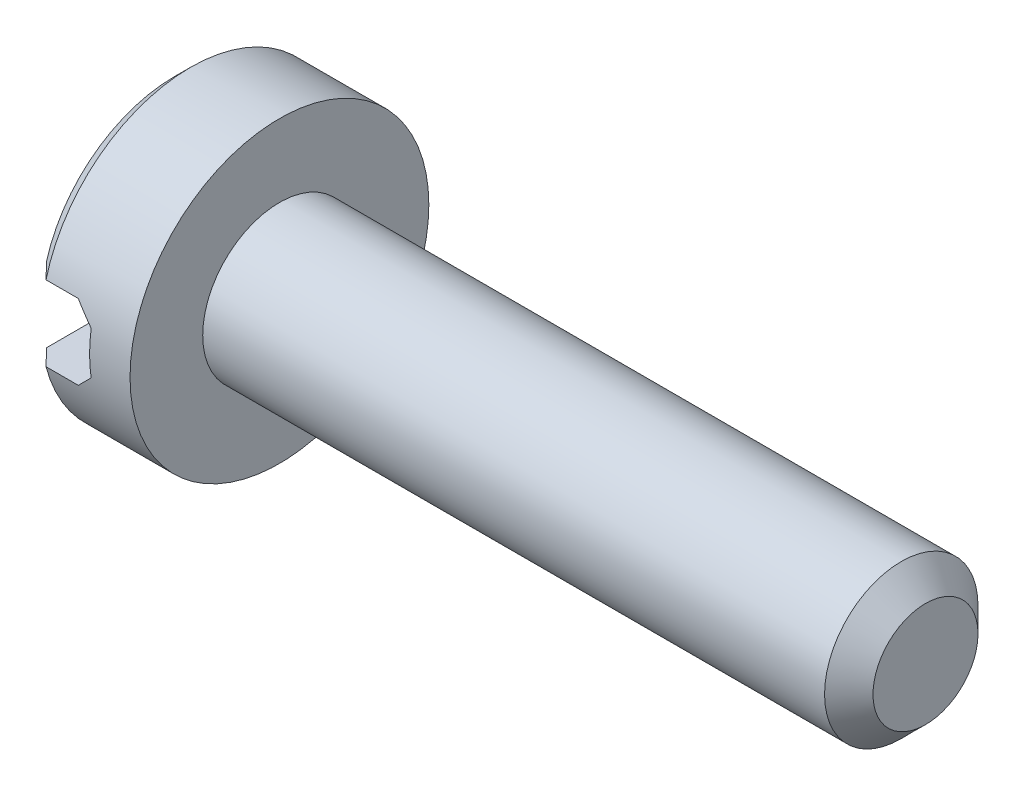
ISO-10303-21;
HEADER;
FILE_DESCRIPTION(('STEP AP214'),'2;1');
FILE_NAME('part.step','',(''),(''),'','','');
FILE_SCHEMA(('AUTOMOTIVE_DESIGN { 1 0 10303 214 1 1 1 1 }'));
ENDSEC;
DATA;
#1=APPLICATION_CONTEXT('core data for automotive mechanical design processes');
#2=APPLICATION_PROTOCOL_DEFINITION('international standard','automotive_design',2000,#1);
#3=PRODUCT_CONTEXT('',#1,'mechanical');
#4=PRODUCT('Part','Part','',(#3));
#5=PRODUCT_RELATED_PRODUCT_CATEGORY('part','',(#4));
#6=PRODUCT_DEFINITION_FORMATION('','',#4);
#7=PRODUCT_DEFINITION_CONTEXT('part definition',#1,'design');
#8=PRODUCT_DEFINITION('design','',#6,#7);
#9=PRODUCT_DEFINITION_SHAPE('','',#8);
#10=(LENGTH_UNIT() NAMED_UNIT(*) SI_UNIT(.MILLI.,.METRE.));
#11=(NAMED_UNIT(*) PLANE_ANGLE_UNIT() SI_UNIT($,.RADIAN.));
#12=(NAMED_UNIT(*) SI_UNIT($,.STERADIAN.) SOLID_ANGLE_UNIT());
#13=UNCERTAINTY_MEASURE_WITH_UNIT(LENGTH_MEASURE(1.E-05),#10,'distance_accuracy_value','');
#14=(GEOMETRIC_REPRESENTATION_CONTEXT(3) GLOBAL_UNCERTAINTY_ASSIGNED_CONTEXT((#13)) GLOBAL_UNIT_ASSIGNED_CONTEXT((#10,
#11,#12)) REPRESENTATION_CONTEXT('',''));
#15=CARTESIAN_POINT('',(0.,0.,0.));
#16=DIRECTION('',(0.,0.,1.));
#17=DIRECTION('',(1.,0.,0.));
#18=AXIS2_PLACEMENT_3D('',#15,#16,#17);
#19=CARTESIAN_POINT('',(1.3,1.85,0.));
#20=DIRECTION('',(-1.,0.,0.));
#21=DIRECTION('',(0.,0.,1.));
#22=AXIS2_PLACEMENT_3D('',#19,#20,#21);
#23=PLANE('',#22);
#24=CARTESIAN_POINT('',(1.3,0.,0.));
#25=DIRECTION('',(-1.,0.,0.));
#26=DIRECTION('',(0.,0.,1.));
#27=AXIS2_PLACEMENT_3D('',#24,#25,#26);
#28=CIRCLE('',#27,1.85);
#29=CARTESIAN_POINT('',(1.3,0.,1.85));
#30=VERTEX_POINT('',#29);
#31=EDGE_CURVE('E111',#30,#30,#28,.T.);
#32=ORIENTED_EDGE('',*,*,#31,.F.);
#33=EDGE_LOOP('',(#32));
#34=FACE_BOUND('',#33,.T.);
#35=CARTESIAN_POINT('',(1.3,0.,0.));
#36=DIRECTION('',(-1.,0.,0.));
#37=DIRECTION('',(0.,0.,1.));
#38=AXIS2_PLACEMENT_3D('',#35,#36,#37);
#39=CIRCLE('',#38,0.95);
#40=CARTESIAN_POINT('',(1.3,0.,0.95));
#41=VERTEX_POINT('',#40);
#42=EDGE_CURVE('E150',#41,#41,#39,.F.);
#43=ORIENTED_EDGE('',*,*,#42,.F.);
#44=EDGE_LOOP('',(#43));
#45=FACE_BOUND('',#44,.T.);
#46=ADVANCED_FACE('F37',(#34,#45),#23,.F.);
#47=CARTESIAN_POINT('',(0.2,0.,0.));
#48=DIRECTION('',(1.,0.,0.));
#49=DIRECTION('',(0.,0.,-1.));
#50=AXIS2_PLACEMENT_3D('',#47,#48,#49);
#51=CONICAL_SURFACE('',#50,1.85,0.785398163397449);
#52=CARTESIAN_POINT('',(0.2,0.,0.));
#53=DIRECTION('',(-1.,0.,0.));
#54=DIRECTION('',(0.,0.,1.));
#55=AXIS2_PLACEMENT_3D('',#52,#53,#54);
#56=CIRCLE('',#55,1.85);
#57=CARTESIAN_POINT('',(0.2,0.465549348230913,1.79046468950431));
#58=VERTEX_POINT('',#57);
#59=CARTESIAN_POINT('',(0.2,0.465549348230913,-1.79046468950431));
#60=VERTEX_POINT('',#59);
#61=EDGE_CURVE('E132',#58,#60,#56,.T.);
#62=ORIENTED_EDGE('',*,*,#61,.T.);
#63=CARTESIAN_POINT('',(2.42344087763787,0.465549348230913,-4.04674985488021));
#64=CARTESIAN_POINT('',(2.31422073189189,0.465549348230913,-3.9368070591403));
#65=CARTESIAN_POINT('',(2.20502763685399,0.465549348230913,-3.82683737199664));
#66=CARTESIAN_POINT('',(1.98669704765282,0.465549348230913,-3.60680197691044));
#67=CARTESIAN_POINT('',(1.87755956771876,0.465549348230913,-3.49673625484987));
#68=CARTESIAN_POINT('',(1.65894933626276,0.465549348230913,-3.27607034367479));
#69=CARTESIAN_POINT('',(1.54947697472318,0.465549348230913,-3.16546976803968));
#70=CARTESIAN_POINT('',(1.33068893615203,0.465549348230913,-2.94415427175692));
#71=CARTESIAN_POINT('',(1.22137323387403,0.465549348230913,-2.83343937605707));
#72=CARTESIAN_POINT('',(0.94158553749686,0.465549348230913,-2.54959909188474));
#73=CARTESIAN_POINT('',(0.771245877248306,0.465549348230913,-2.37634297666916));
#74=CARTESIAN_POINT('',(0.516315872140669,0.465549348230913,-2.11577452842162));
#75=CARTESIAN_POINT('',(0.431406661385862,0.465549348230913,-2.02877427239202));
#76=CARTESIAN_POINT('',(0.261908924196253,0.465549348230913,-1.85447495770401));
#77=CARTESIAN_POINT('',(0.177320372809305,0.465549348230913,-1.76717592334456));
#78=CARTESIAN_POINT('',(0.00893926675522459,0.465549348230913,-1.59244630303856));
#79=CARTESIAN_POINT('',(-0.0748550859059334,0.465549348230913,-1.50501745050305));
#80=CARTESIAN_POINT('',(-0.241707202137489,0.465549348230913,-1.32940591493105));
#81=CARTESIAN_POINT('',(-0.324764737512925,0.465549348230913,-1.24122301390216));
#82=CARTESIAN_POINT('',(-0.448249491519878,0.465549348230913,-1.10803308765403));
#83=CARTESIAN_POINT('',(-0.4892012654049,0.465549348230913,-1.06351303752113));
#84=CARTESIAN_POINT('',(-0.570603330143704,0.465549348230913,-0.974017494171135));
#85=CARTESIAN_POINT('',(-0.61105363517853,0.465549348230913,-0.929042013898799));
#86=CARTESIAN_POINT('',(-0.691196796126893,0.465549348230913,-0.838458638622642));
#87=CARTESIAN_POINT('',(-0.730890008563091,0.465549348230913,-0.792851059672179));
#88=CARTESIAN_POINT('',(-0.809128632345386,0.465549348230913,-0.700664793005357));
#89=CARTESIAN_POINT('',(-0.847674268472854,0.465549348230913,-0.654086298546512));
#90=CARTESIAN_POINT('',(-0.899367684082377,0.465549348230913,-0.588920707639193));
#91=CARTESIAN_POINT('',(-0.913355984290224,0.465549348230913,-0.571002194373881));
#92=CARTESIAN_POINT('',(-0.940978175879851,0.465549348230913,-0.53489334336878));
#93=CARTESIAN_POINT('',(-0.954612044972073,0.465549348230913,-0.516702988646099));
#94=CARTESIAN_POINT('',(-0.994922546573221,0.465549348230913,-0.461548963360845));
#95=CARTESIAN_POINT('',(-1.02093788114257,0.465549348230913,-0.424089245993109));
#96=CARTESIAN_POINT('',(-1.06919063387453,0.465549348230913,-0.348468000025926));
#97=CARTESIAN_POINT('',(-1.09152270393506,0.465549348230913,-0.310367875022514));
#98=CARTESIAN_POINT('',(-1.13109948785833,0.465549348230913,-0.231663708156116));
#99=CARTESIAN_POINT('',(-1.1483700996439,0.465549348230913,-0.191073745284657));
#100=CARTESIAN_POINT('',(-1.16937161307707,0.465549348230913,-0.122137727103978));
#101=CARTESIAN_POINT('',(-1.17573754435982,0.465549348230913,-0.0946292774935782));
#102=CARTESIAN_POINT('',(-1.18362415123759,0.465549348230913,-0.0389959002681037));
#103=CARTESIAN_POINT('',(-1.1851644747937,0.465549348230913,-0.0108739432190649));
#104=CARTESIAN_POINT('',(-1.18310496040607,0.465549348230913,0.0451823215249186));
#105=CARTESIAN_POINT('',(-1.17950248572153,0.465549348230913,0.0731165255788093));
#106=CARTESIAN_POINT('',(-1.16789735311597,0.465549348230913,0.128135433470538));
#107=CARTESIAN_POINT('',(-1.15987428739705,0.465549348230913,0.155215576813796));
#108=CARTESIAN_POINT('',(-1.13863829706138,0.465549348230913,0.213647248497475));
#109=CARTESIAN_POINT('',(-1.12469509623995,0.465549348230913,0.244723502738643));
#110=CARTESIAN_POINT('',(-1.09383840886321,0.465549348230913,0.305390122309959));
#111=CARTESIAN_POINT('',(-1.07691840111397,0.465549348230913,0.334977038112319));
#112=CARTESIAN_POINT('',(-1.04106417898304,0.465549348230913,0.393185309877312));
#113=CARTESIAN_POINT('',(-1.02211606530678,0.465549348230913,0.421797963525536));
#114=CARTESIAN_POINT('',(-0.982981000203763,0.465549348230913,0.478106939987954));
#115=CARTESIAN_POINT('',(-0.962795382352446,0.465549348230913,0.505804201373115));
#116=CARTESIAN_POINT('',(-0.919274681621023,0.465549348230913,0.563580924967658));
#117=CARTESIAN_POINT('',(-0.895838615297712,0.465549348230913,0.593583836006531));
#118=CARTESIAN_POINT('',(-0.848230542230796,0.465549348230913,0.65300190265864));
#119=CARTESIAN_POINT('',(-0.82405844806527,0.465549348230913,0.682416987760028));
#120=CARTESIAN_POINT('',(-0.750747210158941,0.465549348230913,0.770035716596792));
#121=CARTESIAN_POINT('',(-0.700832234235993,0.465549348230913,0.827588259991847));
#122=CARTESIAN_POINT('',(-0.599780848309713,0.465549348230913,0.941762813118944));
#123=CARTESIAN_POINT('',(-0.548642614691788,0.465549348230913,0.998383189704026));
#124=CARTESIAN_POINT('',(-0.445660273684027,0.465549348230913,1.11095186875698));
#125=CARTESIAN_POINT('',(-0.393816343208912,0.465549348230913,1.16690033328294));
#126=CARTESIAN_POINT('',(-0.289869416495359,0.465549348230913,1.27812634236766));
#127=CARTESIAN_POINT('',(-0.237768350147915,0.465549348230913,1.33340569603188));
#128=CARTESIAN_POINT('',(-0.133235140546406,0.465549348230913,1.44365673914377));
#129=CARTESIAN_POINT('',(-0.0808029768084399,0.465549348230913,1.49862840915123));
#130=CARTESIAN_POINT('',(0.0767523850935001,0.465549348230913,1.66311055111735));
#131=CARTESIAN_POINT('',(0.182225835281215,0.465549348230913,1.77228519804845));
#132=CARTESIAN_POINT('',(0.46430719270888,0.465549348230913,2.06287985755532));
#133=CARTESIAN_POINT('',(0.641375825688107,0.465549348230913,2.24385154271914));
#134=CARTESIAN_POINT('',(0.996250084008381,0.465549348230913,2.60519009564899));
#135=CARTESIAN_POINT('',(1.17405593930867,0.465549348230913,2.7855567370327));
#136=CARTESIAN_POINT('',(1.53035733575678,0.465549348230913,3.14622495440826));
#137=CARTESIAN_POINT('',(1.70885353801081,0.465549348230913,3.32652587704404));
#138=CARTESIAN_POINT('',(2.06602855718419,0.465549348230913,3.68681939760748));
#139=CARTESIAN_POINT('',(2.24470728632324,0.465549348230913,3.86681208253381));
#140=CARTESIAN_POINT('',(2.42344087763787,0.465549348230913,4.04674985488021));
#141=B_SPLINE_CURVE_WITH_KNOTS('',3,(#63,#64,#65,#66,#67,#68,#69,#70,#71,#72,#73,#74,#75,#76,
#77,#78,#79,#80,#81,#82,#83,#84,#85,#86,#87,#88,#89,#90,#91,#92,#93,#94,#95,#96,#97,#98,#99,
#100,#101,#102,#103,#104,#105,#106,#107,#108,#109,#110,#111,#112,#113,#114,#115,#116,#117,#118,
#119,#120,#121,#122,#123,#124,#125,#126,#127,#128,#129,#130,#131,#132,#133,#134,#135,#136,#137,
#138,#139,#140),.UNSPECIFIED.,.F.,.F.,(4,2,2,2,2,2,2,2,2,2,2,2,2,2,2,2,2,2,2,2,2,2,2,2,2,2,2,2,
2,2,2,2,2,2,2,2,2,2,4),(0.,0.46491734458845,0.929921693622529,1.39677290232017,1.86353771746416,
2.59243863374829,2.95714021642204,3.32181281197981,3.68511212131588,4.04852027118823,
4.22998896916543,4.41145252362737,4.59282840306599,4.77416851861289,4.84236041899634,
4.91055659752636,5.04728388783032,5.17961007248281,5.31124686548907,5.39561130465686,
5.47963179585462,5.56369538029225,5.64815033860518,5.75007643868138,5.85222867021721,
5.95513223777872,6.05792679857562,6.17212384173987,6.28633450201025,6.51484917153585,
6.74372884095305,6.97255215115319,7.20043854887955,7.42833918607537,7.88374058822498,
8.64329990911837,9.40311729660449,10.1642502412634,10.9251118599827),.UNSPECIFIED.);
#142=CARTESIAN_POINT('',(0.,0.465549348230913,-1.58296045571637));
#143=VERTEX_POINT('',#142);
#144=EDGE_CURVE('E128',#60,#143,#141,.T.);
#145=ORIENTED_EDGE('',*,*,#144,.T.);
#146=CARTESIAN_POINT('',(0.,0.,0.));
#147=DIRECTION('',(-1.,0.,0.));
#148=DIRECTION('',(0.,0.,1.));
#149=AXIS2_PLACEMENT_3D('',#146,#147,#148);
#150=CIRCLE('',#149,1.65);
#151=CARTESIAN_POINT('',(0.,0.465549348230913,1.58296045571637));
#152=VERTEX_POINT('',#151);
#153=EDGE_CURVE('E123',#152,#143,#150,.T.);
#154=ORIENTED_EDGE('',*,*,#153,.F.);
#155=EDGE_CURVE('E191',#152,#58,#141,.T.);
#156=ORIENTED_EDGE('',*,*,#155,.T.);
#157=EDGE_LOOP('',(#62,#145,#154,#156));
#158=FACE_BOUND('',#157,.T.);
#159=ADVANCED_FACE('F166',(#158),#51,.T.);
#160=CARTESIAN_POINT('',(0.,0.,0.));
#161=DIRECTION('',(1.,0.,0.));
#162=DIRECTION('',(0.,0.,-1.));
#163=AXIS2_PLACEMENT_3D('',#160,#161,#162);
#164=PLANE('',#163);
#165=ORIENTED_EDGE('',*,*,#153,.T.);
#166=DIRECTION('',(0.,0.,1.));
#167=VECTOR('',#166,1.);
#168=CARTESIAN_POINT('',(0.,0.465549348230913,0.));
#169=LINE('',#168,#167);
#170=EDGE_CURVE('E110',#143,#152,#169,.T.);
#171=ORIENTED_EDGE('',*,*,#170,.T.);
#172=EDGE_LOOP('',(#165,#171));
#173=FACE_BOUND('',#172,.T.);
#174=ADVANCED_FACE('F171',(#173),#164,.F.);
#175=CARTESIAN_POINT('',(0.,0.,0.));
#176=DIRECTION('',(-1.,0.,0.));
#177=DIRECTION('',(0.,0.,1.));
#178=AXIS2_PLACEMENT_3D('',#175,#176,#177);
#179=CYLINDRICAL_SURFACE('',#178,1.85);
#180=ORIENTED_EDGE('',*,*,#61,.F.);
#181=DIRECTION('',(-1.,0.,0.));
#182=VECTOR('',#181,1.);
#183=CARTESIAN_POINT('',(0.,0.465549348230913,1.79046468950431));
#184=LINE('',#183,#182);
#185=CARTESIAN_POINT('',(0.6,0.465549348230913,1.79046468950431));
#186=VERTEX_POINT('',#185);
#187=EDGE_CURVE('E198',#58,#186,#184,.F.);
#188=ORIENTED_EDGE('',*,*,#187,.T.);
#189=CARTESIAN_POINT('',(1.06554934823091,0.,0.));
#190=DIRECTION('',(0.707106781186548,0.707106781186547,0.));
#191=DIRECTION('',(-0.707106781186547,0.707106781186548,0.));
#192=AXIS2_PLACEMENT_3D('',#189,#190,#191);
#193=ELLIPSE('',#192,2.61629509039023,1.85);
#194=CARTESIAN_POINT('',(0.8,0.265549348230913,1.83084230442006));
#195=VERTEX_POINT('',#194);
#196=EDGE_CURVE('E149',#186,#195,#193,.T.);
#197=ORIENTED_EDGE('',*,*,#196,.T.);
#198=CARTESIAN_POINT('',(0.8,0.,0.));
#199=DIRECTION('',(1.,0.,0.));
#200=DIRECTION('',(0.,0.,-1.));
#201=AXIS2_PLACEMENT_3D('',#198,#199,#200);
#202=CIRCLE('',#201,1.85);
#203=CARTESIAN_POINT('',(0.8,-0.265549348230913,1.83084230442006));
#204=VERTEX_POINT('',#203);
#205=EDGE_CURVE('E60',#195,#204,#202,.T.);
#206=ORIENTED_EDGE('',*,*,#205,.T.);
#207=CARTESIAN_POINT('',(1.06554934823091,0.,0.));
#208=DIRECTION('',(0.707106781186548,-0.707106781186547,0.));
#209=DIRECTION('',(-0.707106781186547,-0.707106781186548,0.));
#210=AXIS2_PLACEMENT_3D('',#207,#208,#209);
#211=ELLIPSE('',#210,2.61629509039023,1.85);
#212=CARTESIAN_POINT('',(0.6,-0.465549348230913,1.79046468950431));
#213=VERTEX_POINT('',#212);
#214=EDGE_CURVE('E143',#204,#213,#211,.T.);
#215=ORIENTED_EDGE('',*,*,#214,.T.);
#216=DIRECTION('',(-1.,0.,0.));
#217=VECTOR('',#216,1.);
#218=CARTESIAN_POINT('',(0.,-0.465549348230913,1.79046468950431));
#219=LINE('',#218,#217);
#220=CARTESIAN_POINT('',(0.2,-0.465549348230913,1.79046468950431));
#221=VERTEX_POINT('',#220);
#222=EDGE_CURVE('E119',#213,#221,#219,.T.);
#223=ORIENTED_EDGE('',*,*,#222,.T.);
#224=CARTESIAN_POINT('',(0.2,-0.465549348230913,-1.79046468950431));
#225=VERTEX_POINT('',#224);
#226=EDGE_CURVE('E118',#225,#221,#56,.T.);
#227=ORIENTED_EDGE('',*,*,#226,.F.);
#228=DIRECTION('',(-1.,0.,0.));
#229=VECTOR('',#228,1.);
#230=CARTESIAN_POINT('',(0.,-0.465549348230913,-1.79046468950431));
#231=LINE('',#230,#229);
#232=CARTESIAN_POINT('',(0.6,-0.465549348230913,-1.79046468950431));
#233=VERTEX_POINT('',#232);
#234=EDGE_CURVE('E120',#225,#233,#231,.F.);
#235=ORIENTED_EDGE('',*,*,#234,.T.);
#236=CARTESIAN_POINT('',(0.8,-0.265549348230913,-1.83084230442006));
#237=VERTEX_POINT('',#236);
#238=EDGE_CURVE('E139',#233,#237,#211,.T.);
#239=ORIENTED_EDGE('',*,*,#238,.T.);
#240=CARTESIAN_POINT('',(0.8,0.265549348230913,-1.83084230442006));
#241=VERTEX_POINT('',#240);
#242=EDGE_CURVE('E142',#237,#241,#202,.T.);
#243=ORIENTED_EDGE('',*,*,#242,.T.);
#244=CARTESIAN_POINT('',(0.6,0.465549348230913,-1.79046468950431));
#245=VERTEX_POINT('',#244);
#246=EDGE_CURVE('E146',#241,#245,#193,.T.);
#247=ORIENTED_EDGE('',*,*,#246,.T.);
#248=DIRECTION('',(-1.,0.,0.));
#249=VECTOR('',#248,1.);
#250=CARTESIAN_POINT('',(0.,0.465549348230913,-1.79046468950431));
#251=LINE('',#250,#249);
#252=EDGE_CURVE('E124',#245,#60,#251,.T.);
#253=ORIENTED_EDGE('',*,*,#252,.T.);
#254=EDGE_LOOP('',(#180,#188,#197,#206,#215,#223,#227,#235,#239,#243,#247,#253));
#255=FACE_BOUND('',#254,.T.);
#256=ORIENTED_EDGE('',*,*,#31,.T.);
#257=EDGE_LOOP('',(#256));
#258=FACE_BOUND('',#257,.T.);
#259=ADVANCED_FACE('F177',(#255,#258),#179,.T.);
#260=ORIENTED_EDGE('',*,*,#226,.T.);
#261=CARTESIAN_POINT('',(2.42344087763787,-0.465549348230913,4.0467498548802));
#262=CARTESIAN_POINT('',(2.31422073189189,-0.465549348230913,3.9368070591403));
#263=CARTESIAN_POINT('',(2.20502763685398,-0.465549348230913,3.82683737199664));
#264=CARTESIAN_POINT('',(1.98669704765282,-0.465549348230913,3.60680197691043));
#265=CARTESIAN_POINT('',(1.87755956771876,-0.465549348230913,3.49673625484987));
#266=CARTESIAN_POINT('',(1.65894933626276,-0.465549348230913,3.27607034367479));
#267=CARTESIAN_POINT('',(1.54947697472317,-0.465549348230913,3.16546976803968));
#268=CARTESIAN_POINT('',(1.33068893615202,-0.465549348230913,2.94415427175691));
#269=CARTESIAN_POINT('',(1.22137323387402,-0.465549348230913,2.83343937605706));
#270=CARTESIAN_POINT('',(0.941585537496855,-0.465549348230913,2.54959909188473));
#271=CARTESIAN_POINT('',(0.771245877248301,-0.465549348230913,2.37634297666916));
#272=CARTESIAN_POINT('',(0.516315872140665,-0.465549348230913,2.11577452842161));
#273=CARTESIAN_POINT('',(0.431406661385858,-0.465549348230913,2.02877427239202));
#274=CARTESIAN_POINT('',(0.261908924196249,-0.465549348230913,1.85447495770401));
#275=CARTESIAN_POINT('',(0.177320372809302,-0.465549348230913,1.76717592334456));
#276=CARTESIAN_POINT('',(0.00893926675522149,-0.465549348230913,1.59244630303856));
#277=CARTESIAN_POINT('',(-0.0748550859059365,-0.465549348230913,1.50501745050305));
#278=CARTESIAN_POINT('',(-0.241707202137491,-0.465549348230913,1.32940591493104));
#279=CARTESIAN_POINT('',(-0.324764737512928,-0.465549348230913,1.24122301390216));
#280=CARTESIAN_POINT('',(-0.44824949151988,-0.465549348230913,1.10803308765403));
#281=CARTESIAN_POINT('',(-0.489201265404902,-0.465549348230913,1.06351303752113));
#282=CARTESIAN_POINT('',(-0.570603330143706,-0.465549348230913,0.974017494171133));
#283=CARTESIAN_POINT('',(-0.611053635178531,-0.465549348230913,0.929042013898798));
#284=CARTESIAN_POINT('',(-0.691196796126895,-0.465549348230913,0.83845863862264));
#285=CARTESIAN_POINT('',(-0.730890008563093,-0.465549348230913,0.792851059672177));
#286=CARTESIAN_POINT('',(-0.809128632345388,-0.465549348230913,0.700664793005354));
#287=CARTESIAN_POINT('',(-0.847674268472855,-0.465549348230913,0.65408629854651));
#288=CARTESIAN_POINT('',(-0.899367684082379,-0.465549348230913,0.588920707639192));
#289=CARTESIAN_POINT('',(-0.913355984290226,-0.465549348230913,0.571002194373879));
#290=CARTESIAN_POINT('',(-0.940978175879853,-0.465549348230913,0.534893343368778));
#291=CARTESIAN_POINT('',(-0.954612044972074,-0.465549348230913,0.516702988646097));
#292=CARTESIAN_POINT('',(-0.994922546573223,-0.465549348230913,0.461548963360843));
#293=CARTESIAN_POINT('',(-1.02093788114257,-0.465549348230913,0.424089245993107));
#294=CARTESIAN_POINT('',(-1.06919063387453,-0.465549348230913,0.348468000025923));
#295=CARTESIAN_POINT('',(-1.09152270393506,-0.465549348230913,0.310367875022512));
#296=CARTESIAN_POINT('',(-1.13109948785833,-0.465549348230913,0.231663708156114));
#297=CARTESIAN_POINT('',(-1.1483700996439,-0.465549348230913,0.191073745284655));
#298=CARTESIAN_POINT('',(-1.16937161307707,-0.465549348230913,0.122137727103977));
#299=CARTESIAN_POINT('',(-1.17573754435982,-0.465549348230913,0.0946292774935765));
#300=CARTESIAN_POINT('',(-1.18362415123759,-0.465549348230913,0.0389959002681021));
#301=CARTESIAN_POINT('',(-1.1851644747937,-0.465549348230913,0.0108739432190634));
#302=CARTESIAN_POINT('',(-1.18310496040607,-0.465549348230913,-0.0451823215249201));
#303=CARTESIAN_POINT('',(-1.17950248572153,-0.465549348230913,-0.0731165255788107));
#304=CARTESIAN_POINT('',(-1.16789735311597,-0.465549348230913,-0.128135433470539));
#305=CARTESIAN_POINT('',(-1.15987428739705,-0.465549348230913,-0.155215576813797));
#306=CARTESIAN_POINT('',(-1.13863829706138,-0.465549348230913,-0.213647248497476));
#307=CARTESIAN_POINT('',(-1.12469509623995,-0.465549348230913,-0.244723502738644));
#308=CARTESIAN_POINT('',(-1.09383840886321,-0.465549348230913,-0.305390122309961));
#309=CARTESIAN_POINT('',(-1.07691840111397,-0.465549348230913,-0.334977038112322));
#310=CARTESIAN_POINT('',(-1.04106417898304,-0.465549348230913,-0.393185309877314));
#311=CARTESIAN_POINT('',(-1.02211606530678,-0.465549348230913,-0.421797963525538));
#312=CARTESIAN_POINT('',(-0.982981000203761,-0.465549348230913,-0.478106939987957));
#313=CARTESIAN_POINT('',(-0.962795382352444,-0.465549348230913,-0.505804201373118));
#314=CARTESIAN_POINT('',(-0.919274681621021,-0.465549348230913,-0.563580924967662));
#315=CARTESIAN_POINT('',(-0.895838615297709,-0.465549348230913,-0.593583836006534));
#316=CARTESIAN_POINT('',(-0.848230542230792,-0.465549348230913,-0.653001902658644));
#317=CARTESIAN_POINT('',(-0.824058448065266,-0.465549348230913,-0.682416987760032));
#318=CARTESIAN_POINT('',(-0.750747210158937,-0.465549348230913,-0.770035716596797));
#319=CARTESIAN_POINT('',(-0.700832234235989,-0.465549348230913,-0.827588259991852));
#320=CARTESIAN_POINT('',(-0.599780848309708,-0.465549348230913,-0.941762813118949));
#321=CARTESIAN_POINT('',(-0.548642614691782,-0.465549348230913,-0.998383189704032));
#322=CARTESIAN_POINT('',(-0.44566027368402,-0.465549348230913,-1.11095186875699));
#323=CARTESIAN_POINT('',(-0.393816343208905,-0.465549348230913,-1.16690033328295));
#324=CARTESIAN_POINT('',(-0.289869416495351,-0.465549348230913,-1.27812634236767));
#325=CARTESIAN_POINT('',(-0.237768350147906,-0.465549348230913,-1.33340569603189));
#326=CARTESIAN_POINT('',(-0.133235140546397,-0.465549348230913,-1.44365673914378));
#327=CARTESIAN_POINT('',(-0.0808029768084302,-0.465549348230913,-1.49862840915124));
#328=CARTESIAN_POINT('',(0.0767523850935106,-0.465549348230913,-1.66311055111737));
#329=CARTESIAN_POINT('',(0.182225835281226,-0.465549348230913,-1.77228519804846));
#330=CARTESIAN_POINT('',(0.464307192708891,-0.465549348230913,-2.06287985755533));
#331=CARTESIAN_POINT('',(0.641375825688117,-0.465549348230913,-2.24385154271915));
#332=CARTESIAN_POINT('',(0.996250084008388,-0.465549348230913,-2.605190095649));
#333=CARTESIAN_POINT('',(1.17405593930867,-0.465549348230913,-2.7855567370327));
#334=CARTESIAN_POINT('',(1.53035733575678,-0.465549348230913,-3.14622495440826));
#335=CARTESIAN_POINT('',(1.70885353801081,-0.465549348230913,-3.32652587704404));
#336=CARTESIAN_POINT('',(2.06602855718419,-0.465549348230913,-3.68681939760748));
#337=CARTESIAN_POINT('',(2.24470728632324,-0.465549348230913,-3.86681208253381));
#338=CARTESIAN_POINT('',(2.42344087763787,-0.465549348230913,-4.0467498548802));
#339=B_SPLINE_CURVE_WITH_KNOTS('',3,(#261,#262,#263,#264,#265,#266,#267,#268,#269,#270,#271,
#272,#273,#274,#275,#276,#277,#278,#279,#280,#281,#282,#283,#284,#285,#286,#287,#288,#289,#290,
#291,#292,#293,#294,#295,#296,#297,#298,#299,#300,#301,#302,#303,#304,#305,#306,#307,#308,#309,
#310,#311,#312,#313,#314,#315,#316,#317,#318,#319,#320,#321,#322,#323,#324,#325,#326,#327,#328,
#329,#330,#331,#332,#333,#334,#335,#336,#337,#338),.UNSPECIFIED.,.F.,.F.,(4,2,2,2,2,2,2,2,2,2,2,
2,2,2,2,2,2,2,2,2,2,2,2,2,2,2,2,2,2,2,2,2,2,2,2,2,2,2,4),(0.,0.46491734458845,0.929921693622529,
1.39677290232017,1.86353771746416,2.59243863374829,2.95714021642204,3.32181281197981,
3.68511212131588,4.04852027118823,4.22998896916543,4.41145252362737,4.59282840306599,
4.77416851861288,4.84236041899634,4.91055659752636,5.04728388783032,5.1796100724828,
5.31124686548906,5.39561130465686,5.47963179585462,5.56369538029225,5.64815033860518,
5.75007643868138,5.85222867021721,5.95513223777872,6.05792679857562,6.17212384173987,
6.28633450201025,6.51484917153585,6.74372884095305,6.97255215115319,7.20043854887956,
7.42833918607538,7.883740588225,8.64329990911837,9.40311729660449,10.1642502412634,
10.9251118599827),.UNSPECIFIED.);
#340=CARTESIAN_POINT('',(0.,-0.465549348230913,1.58296045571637));
#341=VERTEX_POINT('',#340);
#342=EDGE_CURVE('E105',#221,#341,#339,.T.);
#343=ORIENTED_EDGE('',*,*,#342,.T.);
#344=CARTESIAN_POINT('',(0.,-0.465549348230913,-1.58296045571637));
#345=VERTEX_POINT('',#344);
#346=EDGE_CURVE('E116',#345,#341,#150,.T.);
#347=ORIENTED_EDGE('',*,*,#346,.F.);
#348=EDGE_CURVE('E52',#345,#225,#339,.T.);
#349=ORIENTED_EDGE('',*,*,#348,.T.);
#350=EDGE_LOOP('',(#260,#343,#347,#349));
#351=FACE_BOUND('',#350,.T.);
#352=ADVANCED_FACE('F115',(#351),#51,.T.);
#353=ORIENTED_EDGE('',*,*,#346,.T.);
#354=DIRECTION('',(0.,0.,-1.));
#355=VECTOR('',#354,1.);
#356=CARTESIAN_POINT('',(0.,-0.465549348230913,0.));
#357=LINE('',#356,#355);
#358=EDGE_CURVE('E101',#341,#345,#357,.T.);
#359=ORIENTED_EDGE('',*,*,#358,.T.);
#360=EDGE_LOOP('',(#353,#359));
#361=FACE_BOUND('',#360,.T.);
#362=ADVANCED_FACE('F122',(#361),#164,.F.);
#363=CARTESIAN_POINT('',(0.6,0.465549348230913,-5.));
#364=DIRECTION('',(0.707106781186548,0.707106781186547,0.));
#365=DIRECTION('',(-0.707106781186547,0.707106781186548,0.));
#366=AXIS2_PLACEMENT_3D('',#363,#364,#365);
#367=PLANE('',#366);
#368=DIRECTION('',(0.,0.,1.));
#369=VECTOR('',#368,1.);
#370=CARTESIAN_POINT('',(0.6,0.465549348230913,-5.));
#371=LINE('',#370,#369);
#372=EDGE_CURVE('E312',#245,#186,#371,.T.);
#373=ORIENTED_EDGE('',*,*,#372,.F.);
#374=ORIENTED_EDGE('',*,*,#246,.F.);
#375=DIRECTION('',(0.,0.,1.));
#376=VECTOR('',#375,1.);
#377=CARTESIAN_POINT('',(0.8,0.265549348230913,-5.));
#378=LINE('',#377,#376);
#379=EDGE_CURVE('E313',#241,#195,#378,.T.);
#380=ORIENTED_EDGE('',*,*,#379,.T.);
#381=ORIENTED_EDGE('',*,*,#196,.F.);
#382=EDGE_LOOP('',(#373,#374,#380,#381));
#383=FACE_BOUND('',#382,.T.);
#384=ADVANCED_FACE('F206',(#383),#367,.F.);
#385=CARTESIAN_POINT('',(0.8,0.265549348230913,-5.));
#386=DIRECTION('',(1.,0.,0.));
#387=DIRECTION('',(0.,0.,-1.));
#388=AXIS2_PLACEMENT_3D('',#385,#386,#387);
#389=PLANE('',#388);
#390=ORIENTED_EDGE('',*,*,#379,.F.);
#391=ORIENTED_EDGE('',*,*,#242,.F.);
#392=DIRECTION('',(0.,0.,1.));
#393=VECTOR('',#392,1.);
#394=CARTESIAN_POINT('',(0.8,-0.265549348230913,-5.));
#395=LINE('',#394,#393);
#396=EDGE_CURVE('E315',#237,#204,#395,.T.);
#397=ORIENTED_EDGE('',*,*,#396,.T.);
#398=ORIENTED_EDGE('',*,*,#205,.F.);
#399=EDGE_LOOP('',(#390,#391,#397,#398));
#400=FACE_BOUND('',#399,.T.);
#401=ADVANCED_FACE('F209',(#400),#389,.F.);
#402=CARTESIAN_POINT('',(0.6,-0.465549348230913,-5.));
#403=DIRECTION('',(0.707106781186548,-0.707106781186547,0.));
#404=DIRECTION('',(0.707106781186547,0.707106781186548,0.));
#405=AXIS2_PLACEMENT_3D('',#402,#403,#404);
#406=PLANE('',#405);
#407=DIRECTION('',(0.,0.,1.));
#408=VECTOR('',#407,1.);
#409=CARTESIAN_POINT('',(0.6,-0.465549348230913,-5.));
#410=LINE('',#409,#408);
#411=EDGE_CURVE('E318',#233,#213,#410,.T.);
#412=ORIENTED_EDGE('',*,*,#411,.T.);
#413=ORIENTED_EDGE('',*,*,#214,.F.);
#414=ORIENTED_EDGE('',*,*,#396,.F.);
#415=ORIENTED_EDGE('',*,*,#238,.F.);
#416=EDGE_LOOP('',(#412,#413,#414,#415));
#417=FACE_BOUND('',#416,.T.);
#418=ADVANCED_FACE('F204',(#417),#406,.F.);
#419=CARTESIAN_POINT('',(0.,0.465549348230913,-5.));
#420=DIRECTION('',(0.,1.,0.));
#421=DIRECTION('',(0.,0.,1.));
#422=AXIS2_PLACEMENT_3D('',#419,#420,#421);
#423=PLANE('',#422);
#424=ORIENTED_EDGE('',*,*,#372,.T.);
#425=ORIENTED_EDGE('',*,*,#187,.F.);
#426=ORIENTED_EDGE('',*,*,#155,.F.);
#427=ORIENTED_EDGE('',*,*,#170,.F.);
#428=ORIENTED_EDGE('',*,*,#144,.F.);
#429=ORIENTED_EDGE('',*,*,#252,.F.);
#430=EDGE_LOOP('',(#424,#425,#426,#427,#428,#429));
#431=FACE_BOUND('',#430,.T.);
#432=ADVANCED_FACE('F199',(#431),#423,.F.);
#433=CARTESIAN_POINT('',(0.,-0.465549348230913,-5.));
#434=DIRECTION('',(0.,-1.,0.));
#435=DIRECTION('',(0.,0.,-1.));
#436=AXIS2_PLACEMENT_3D('',#433,#434,#435);
#437=PLANE('',#436);
#438=ORIENTED_EDGE('',*,*,#411,.F.);
#439=ORIENTED_EDGE('',*,*,#234,.F.);
#440=ORIENTED_EDGE('',*,*,#348,.F.);
#441=ORIENTED_EDGE('',*,*,#358,.F.);
#442=ORIENTED_EDGE('',*,*,#342,.F.);
#443=ORIENTED_EDGE('',*,*,#222,.F.);
#444=EDGE_LOOP('',(#438,#439,#440,#441,#442,#443));
#445=FACE_BOUND('',#444,.T.);
#446=ADVANCED_FACE('F104',(#445),#437,.F.);
#447=CARTESIAN_POINT('',(9.3,0.,0.));
#448=DIRECTION('',(-1.,0.,0.));
#449=DIRECTION('',(0.,0.,1.));
#450=AXIS2_PLACEMENT_3D('',#447,#448,#449);
#451=CYLINDRICAL_SURFACE('',#450,0.95);
#452=CARTESIAN_POINT('',(9.,0.,0.));
#453=DIRECTION('',(1.,0.,0.));
#454=DIRECTION('',(0.,0.,-1.));
#455=AXIS2_PLACEMENT_3D('',#452,#453,#454);
#456=CIRCLE('',#455,0.95);
#457=CARTESIAN_POINT('',(9.,0.,-0.95));
#458=VERTEX_POINT('',#457);
#459=EDGE_CURVE('E11',#458,#458,#456,.F.);
#460=ORIENTED_EDGE('',*,*,#459,.T.);
#461=EDGE_LOOP('',(#460));
#462=FACE_BOUND('',#461,.T.);
#463=ORIENTED_EDGE('',*,*,#42,.T.);
#464=EDGE_LOOP('',(#463));
#465=FACE_BOUND('',#464,.T.);
#466=ADVANCED_FACE('F162',(#462,#465),#451,.T.);
#467=CARTESIAN_POINT('',(9.3,0.,0.));
#468=DIRECTION('',(1.,0.,0.));
#469=DIRECTION('',(0.,0.,-1.));
#470=AXIS2_PLACEMENT_3D('',#467,#468,#469);
#471=PLANE('',#470);
#472=CARTESIAN_POINT('',(9.3,0.,0.));
#473=DIRECTION('',(1.,0.,0.));
#474=DIRECTION('',(0.,0.,-1.));
#475=AXIS2_PLACEMENT_3D('',#472,#473,#474);
#476=CIRCLE('',#475,0.649999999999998);
#477=CARTESIAN_POINT('',(9.3,0.,-0.649999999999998));
#478=VERTEX_POINT('',#477);
#479=EDGE_CURVE('E45',#478,#478,#476,.T.);
#480=ORIENTED_EDGE('',*,*,#479,.T.);
#481=EDGE_LOOP('',(#480));
#482=FACE_BOUND('',#481,.T.);
#483=ADVANCED_FACE('F155',(#482),#471,.T.);
#484=CARTESIAN_POINT('',(9.3,0.,0.));
#485=DIRECTION('',(-1.,0.,0.));
#486=DIRECTION('',(0.,0.,1.));
#487=AXIS2_PLACEMENT_3D('',#484,#485,#486);
#488=CONICAL_SURFACE('',#487,0.649999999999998,0.785398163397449);
#489=ORIENTED_EDGE('',*,*,#459,.F.);
#490=EDGE_LOOP('',(#489));
#491=FACE_BOUND('',#490,.T.);
#492=ORIENTED_EDGE('',*,*,#479,.F.);
#493=EDGE_LOOP('',(#492));
#494=FACE_BOUND('',#493,.T.);
#495=ADVANCED_FACE('F39',(#491,#494),#488,.T.);
#496=CLOSED_SHELL('',(#46,#159,#174,#259,#352,#362,#384,#401,#418,#432,#446,#466,#483,#495));
#497=MANIFOLD_SOLID_BREP('B2',#496);
#498=ADVANCED_BREP_SHAPE_REPRESENTATION('',(#18,#497),#14);
#499=SHAPE_DEFINITION_REPRESENTATION(#9,#498);
ENDSEC;
END-ISO-10303-21;
